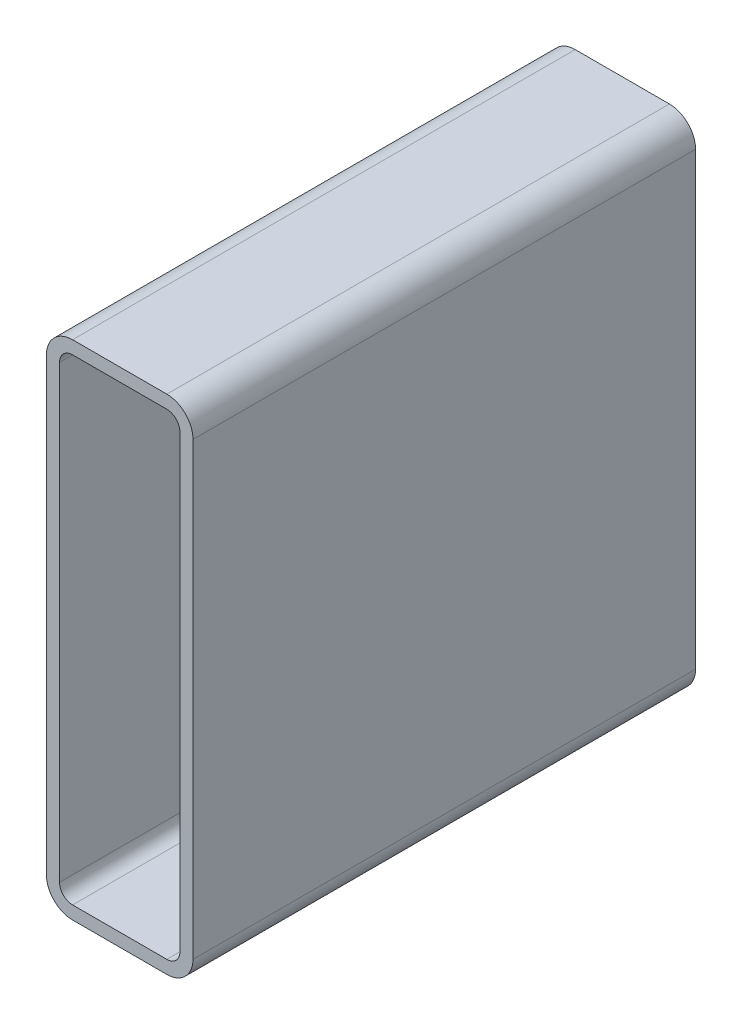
ISO-10303-21;
HEADER;
FILE_DESCRIPTION(('STEP AP214'),'2;1');
FILE_NAME('part.step','',(''),(''),'','','');
FILE_SCHEMA(('AUTOMOTIVE_DESIGN { 1 0 10303 214 1 1 1 1 }'));
ENDSEC;
DATA;
#1=APPLICATION_CONTEXT('core data for automotive mechanical design processes');
#2=APPLICATION_PROTOCOL_DEFINITION('international standard','automotive_design',2000,#1);
#3=PRODUCT_CONTEXT('',#1,'mechanical');
#4=PRODUCT('Part','Part','',(#3));
#5=PRODUCT_RELATED_PRODUCT_CATEGORY('part','',(#4));
#6=PRODUCT_DEFINITION_FORMATION('','',#4);
#7=PRODUCT_DEFINITION_CONTEXT('part definition',#1,'design');
#8=PRODUCT_DEFINITION('design','',#6,#7);
#9=PRODUCT_DEFINITION_SHAPE('','',#8);
#10=(LENGTH_UNIT() NAMED_UNIT(*) SI_UNIT(.MILLI.,.METRE.));
#11=(NAMED_UNIT(*) PLANE_ANGLE_UNIT() SI_UNIT($,.RADIAN.));
#12=(NAMED_UNIT(*) SI_UNIT($,.STERADIAN.) SOLID_ANGLE_UNIT());
#13=UNCERTAINTY_MEASURE_WITH_UNIT(LENGTH_MEASURE(1.E-05),#10,'distance_accuracy_value','');
#14=(GEOMETRIC_REPRESENTATION_CONTEXT(3) GLOBAL_UNCERTAINTY_ASSIGNED_CONTEXT((#13)) GLOBAL_UNIT_ASSIGNED_CONTEXT((#10,
#11,#12)) REPRESENTATION_CONTEXT('',''));
#15=CARTESIAN_POINT('',(0.,0.,0.));
#16=DIRECTION('',(0.,0.,1.));
#17=DIRECTION('',(1.,0.,0.));
#18=AXIS2_PLACEMENT_3D('',#15,#16,#17);
#19=CARTESIAN_POINT('',(17.9571469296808,290.799496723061,304.8));
#20=DIRECTION('',(0.,0.,1.));
#21=DIRECTION('',(1.,0.,0.));
#22=AXIS2_PLACEMENT_3D('',#19,#20,#21);
#23=PLANE('',#22);
#24=CARTESIAN_POINT('',(17.9571469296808,290.799496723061,304.8));
#25=DIRECTION('',(0.,0.,1.));
#26=DIRECTION('',(1.,0.,0.));
#27=AXIS2_PLACEMENT_3D('',#24,#25,#26);
#28=CIRCLE('',#27,15.875);
#29=CARTESIAN_POINT('',(17.9571469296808,306.674496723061,304.8));
#30=VERTEX_POINT('',#29);
#31=CARTESIAN_POINT('',(2.08214692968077,290.799496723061,304.8));
#32=VERTEX_POINT('',#31);
#33=EDGE_CURVE('E211',#30,#32,#28,.T.);
#34=ORIENTED_EDGE('',*,*,#33,.T.);
#35=DIRECTION('',(0.,-1.,0.));
#36=VECTOR('',#35,1.);
#37=CARTESIAN_POINT('',(2.08214692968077,17.7494967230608,304.8));
#38=LINE('',#37,#36);
#39=CARTESIAN_POINT('',(2.08214692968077,17.7494967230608,304.8));
#40=VERTEX_POINT('',#39);
#41=EDGE_CURVE('E214',#32,#40,#38,.T.);
#42=ORIENTED_EDGE('',*,*,#41,.T.);
#43=CARTESIAN_POINT('',(17.9571469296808,17.7494967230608,304.8));
#44=DIRECTION('',(0.,0.,1.));
#45=DIRECTION('',(1.,0.,0.));
#46=AXIS2_PLACEMENT_3D('',#43,#44,#45);
#47=CIRCLE('',#46,15.875);
#48=CARTESIAN_POINT('',(17.9571469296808,1.87449672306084,304.8));
#49=VERTEX_POINT('',#48);
#50=EDGE_CURVE('E217',#40,#49,#47,.T.);
#51=ORIENTED_EDGE('',*,*,#50,.T.);
#52=DIRECTION('',(1.,0.,0.));
#53=VECTOR('',#52,1.);
#54=CARTESIAN_POINT('',(75.1071469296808,1.87449672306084,304.8));
#55=LINE('',#54,#53);
#56=CARTESIAN_POINT('',(75.1071469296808,1.87449672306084,304.8));
#57=VERTEX_POINT('',#56);
#58=EDGE_CURVE('E219',#49,#57,#55,.T.);
#59=ORIENTED_EDGE('',*,*,#58,.T.);
#60=CARTESIAN_POINT('',(75.1071469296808,17.7494967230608,304.8));
#61=DIRECTION('',(0.,0.,1.));
#62=DIRECTION('',(1.,0.,0.));
#63=AXIS2_PLACEMENT_3D('',#60,#61,#62);
#64=CIRCLE('',#63,15.875);
#65=CARTESIAN_POINT('',(90.9821469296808,17.7494967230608,304.8));
#66=VERTEX_POINT('',#65);
#67=EDGE_CURVE('E221',#57,#66,#64,.T.);
#68=ORIENTED_EDGE('',*,*,#67,.T.);
#69=DIRECTION('',(0.,1.,0.));
#70=VECTOR('',#69,1.);
#71=CARTESIAN_POINT('',(90.9821469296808,290.799496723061,304.8));
#72=LINE('',#71,#70);
#73=CARTESIAN_POINT('',(90.9821469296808,290.799496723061,304.8));
#74=VERTEX_POINT('',#73);
#75=EDGE_CURVE('E223',#66,#74,#72,.T.);
#76=ORIENTED_EDGE('',*,*,#75,.T.);
#77=CARTESIAN_POINT('',(75.1071469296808,290.799496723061,304.8));
#78=DIRECTION('',(0.,0.,1.));
#79=DIRECTION('',(1.,0.,0.));
#80=AXIS2_PLACEMENT_3D('',#77,#78,#79);
#81=CIRCLE('',#80,15.875);
#82=CARTESIAN_POINT('',(75.1071469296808,306.674496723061,304.8));
#83=VERTEX_POINT('',#82);
#84=EDGE_CURVE('E225',#74,#83,#81,.T.);
#85=ORIENTED_EDGE('',*,*,#84,.T.);
#86=DIRECTION('',(-1.,0.,0.));
#87=VECTOR('',#86,1.);
#88=CARTESIAN_POINT('',(17.9571469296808,306.674496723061,304.8));
#89=LINE('',#88,#87);
#90=EDGE_CURVE('E227',#83,#30,#89,.T.);
#91=ORIENTED_EDGE('',*,*,#90,.T.);
#92=EDGE_LOOP('',(#34,#42,#51,#59,#68,#76,#85,#91));
#93=FACE_BOUND('',#92,.T.);
#94=DIRECTION('',(0.,-1.,0.));
#95=VECTOR('',#94,1.);
#96=CARTESIAN_POINT('',(10.0196469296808,17.7494967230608,304.8));
#97=LINE('',#96,#95);
#98=CARTESIAN_POINT('',(10.0196469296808,290.799496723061,304.8));
#99=VERTEX_POINT('',#98);
#100=CARTESIAN_POINT('',(10.0196469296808,17.7494967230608,304.8));
#101=VERTEX_POINT('',#100);
#102=EDGE_CURVE('E154',#99,#101,#97,.T.);
#103=ORIENTED_EDGE('',*,*,#102,.F.);
#104=CARTESIAN_POINT('',(17.9571469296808,290.799496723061,304.8));
#105=DIRECTION('',(0.,0.,1.));
#106=DIRECTION('',(1.,0.,0.));
#107=AXIS2_PLACEMENT_3D('',#104,#105,#106);
#108=CIRCLE('',#107,7.9375);
#109=CARTESIAN_POINT('',(17.9571469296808,298.736996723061,304.8));
#110=VERTEX_POINT('',#109);
#111=EDGE_CURVE('E146',#110,#99,#108,.T.);
#112=ORIENTED_EDGE('',*,*,#111,.F.);
#113=DIRECTION('',(-1.,0.,0.));
#114=VECTOR('',#113,1.);
#115=CARTESIAN_POINT('',(17.9571469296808,298.736996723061,304.8));
#116=LINE('',#115,#114);
#117=CARTESIAN_POINT('',(75.1071469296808,298.736996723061,304.8));
#118=VERTEX_POINT('',#117);
#119=EDGE_CURVE('E179',#118,#110,#116,.T.);
#120=ORIENTED_EDGE('',*,*,#119,.F.);
#121=CARTESIAN_POINT('',(75.1071469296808,290.799496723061,304.8));
#122=DIRECTION('',(0.,0.,1.));
#123=DIRECTION('',(1.,0.,0.));
#124=AXIS2_PLACEMENT_3D('',#121,#122,#123);
#125=CIRCLE('',#124,7.93749999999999);
#126=CARTESIAN_POINT('',(83.0446469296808,290.799496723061,304.8));
#127=VERTEX_POINT('',#126);
#128=EDGE_CURVE('E177',#127,#118,#125,.T.);
#129=ORIENTED_EDGE('',*,*,#128,.F.);
#130=DIRECTION('',(0.,1.,0.));
#131=VECTOR('',#130,1.);
#132=CARTESIAN_POINT('',(83.0446469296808,290.799496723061,304.8));
#133=LINE('',#132,#131);
#134=CARTESIAN_POINT('',(83.0446469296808,17.7494967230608,304.8));
#135=VERTEX_POINT('',#134);
#136=EDGE_CURVE('E175',#135,#127,#133,.T.);
#137=ORIENTED_EDGE('',*,*,#136,.F.);
#138=CARTESIAN_POINT('',(75.1071469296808,17.7494967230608,304.8));
#139=DIRECTION('',(0.,0.,1.));
#140=DIRECTION('',(1.,0.,0.));
#141=AXIS2_PLACEMENT_3D('',#138,#139,#140);
#142=CIRCLE('',#141,7.9375);
#143=CARTESIAN_POINT('',(75.1071469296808,9.81199672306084,304.8));
#144=VERTEX_POINT('',#143);
#145=EDGE_CURVE('E173',#144,#135,#142,.T.);
#146=ORIENTED_EDGE('',*,*,#145,.F.);
#147=DIRECTION('',(1.,0.,0.));
#148=VECTOR('',#147,1.);
#149=CARTESIAN_POINT('',(75.1071469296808,9.81199672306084,304.8));
#150=LINE('',#149,#148);
#151=CARTESIAN_POINT('',(17.9571469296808,9.81199672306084,304.8));
#152=VERTEX_POINT('',#151);
#153=EDGE_CURVE('E169',#152,#144,#150,.T.);
#154=ORIENTED_EDGE('',*,*,#153,.F.);
#155=CARTESIAN_POINT('',(17.9571469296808,17.7494967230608,304.8));
#156=DIRECTION('',(0.,0.,1.));
#157=DIRECTION('',(1.,0.,0.));
#158=AXIS2_PLACEMENT_3D('',#155,#156,#157);
#159=CIRCLE('',#158,7.9375);
#160=EDGE_CURVE('E167',#101,#152,#159,.T.);
#161=ORIENTED_EDGE('',*,*,#160,.F.);
#162=EDGE_LOOP('',(#103,#112,#120,#129,#137,#146,#154,#161));
#163=FACE_BOUND('',#162,.T.);
#164=ADVANCED_FACE('F33',(#93,#163),#23,.T.);
#165=CARTESIAN_POINT('',(17.9571469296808,290.799496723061,0.));
#166=DIRECTION('',(0.,0.,1.));
#167=DIRECTION('',(1.,0.,0.));
#168=AXIS2_PLACEMENT_3D('',#165,#166,#167);
#169=PLANE('',#168);
#170=CARTESIAN_POINT('',(17.9571469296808,290.799496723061,0.));
#171=DIRECTION('',(0.,0.,1.));
#172=DIRECTION('',(1.,0.,0.));
#173=AXIS2_PLACEMENT_3D('',#170,#171,#172);
#174=CIRCLE('',#173,15.875);
#175=CARTESIAN_POINT('',(17.9571469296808,306.674496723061,0.));
#176=VERTEX_POINT('',#175);
#177=CARTESIAN_POINT('',(2.08214692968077,290.799496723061,0.));
#178=VERTEX_POINT('',#177);
#179=EDGE_CURVE('E162',#176,#178,#174,.T.);
#180=ORIENTED_EDGE('',*,*,#179,.F.);
#181=DIRECTION('',(-1.,0.,0.));
#182=VECTOR('',#181,1.);
#183=CARTESIAN_POINT('',(17.9571469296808,306.674496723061,0.));
#184=LINE('',#183,#182);
#185=CARTESIAN_POINT('',(75.1071469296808,306.674496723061,0.));
#186=VERTEX_POINT('',#185);
#187=EDGE_CURVE('E215',#186,#176,#184,.T.);
#188=ORIENTED_EDGE('',*,*,#187,.F.);
#189=CARTESIAN_POINT('',(75.1071469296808,290.799496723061,0.));
#190=DIRECTION('',(0.,0.,1.));
#191=DIRECTION('',(1.,0.,0.));
#192=AXIS2_PLACEMENT_3D('',#189,#190,#191);
#193=CIRCLE('',#192,15.875);
#194=CARTESIAN_POINT('',(90.9821469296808,290.799496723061,0.));
#195=VERTEX_POINT('',#194);
#196=EDGE_CURVE('E242',#195,#186,#193,.T.);
#197=ORIENTED_EDGE('',*,*,#196,.F.);
#198=DIRECTION('',(0.,1.,0.));
#199=VECTOR('',#198,1.);
#200=CARTESIAN_POINT('',(90.9821469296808,290.799496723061,0.));
#201=LINE('',#200,#199);
#202=CARTESIAN_POINT('',(90.9821469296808,17.7494967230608,0.));
#203=VERTEX_POINT('',#202);
#204=EDGE_CURVE('E240',#203,#195,#201,.T.);
#205=ORIENTED_EDGE('',*,*,#204,.F.);
#206=CARTESIAN_POINT('',(75.1071469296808,17.7494967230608,0.));
#207=DIRECTION('',(0.,0.,1.));
#208=DIRECTION('',(1.,0.,0.));
#209=AXIS2_PLACEMENT_3D('',#206,#207,#208);
#210=CIRCLE('',#209,15.875);
#211=CARTESIAN_POINT('',(75.1071469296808,1.87449672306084,0.));
#212=VERTEX_POINT('',#211);
#213=EDGE_CURVE('E238',#212,#203,#210,.T.);
#214=ORIENTED_EDGE('',*,*,#213,.F.);
#215=DIRECTION('',(1.,0.,0.));
#216=VECTOR('',#215,1.);
#217=CARTESIAN_POINT('',(75.1071469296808,1.87449672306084,0.));
#218=LINE('',#217,#216);
#219=CARTESIAN_POINT('',(17.9571469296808,1.87449672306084,0.));
#220=VERTEX_POINT('',#219);
#221=EDGE_CURVE('E236',#220,#212,#218,.T.);
#222=ORIENTED_EDGE('',*,*,#221,.F.);
#223=CARTESIAN_POINT('',(17.9571469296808,17.7494967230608,0.));
#224=DIRECTION('',(0.,0.,1.));
#225=DIRECTION('',(1.,0.,0.));
#226=AXIS2_PLACEMENT_3D('',#223,#224,#225);
#227=CIRCLE('',#226,15.875);
#228=CARTESIAN_POINT('',(2.08214692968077,17.7494967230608,0.));
#229=VERTEX_POINT('',#228);
#230=EDGE_CURVE('E234',#229,#220,#227,.T.);
#231=ORIENTED_EDGE('',*,*,#230,.F.);
#232=DIRECTION('',(0.,-1.,0.));
#233=VECTOR('',#232,1.);
#234=CARTESIAN_POINT('',(2.08214692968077,17.7494967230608,0.));
#235=LINE('',#234,#233);
#236=EDGE_CURVE('E232',#178,#229,#235,.T.);
#237=ORIENTED_EDGE('',*,*,#236,.F.);
#238=EDGE_LOOP('',(#180,#188,#197,#205,#214,#222,#231,#237));
#239=FACE_BOUND('',#238,.T.);
#240=CARTESIAN_POINT('',(17.9571469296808,290.799496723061,0.));
#241=DIRECTION('',(0.,0.,1.));
#242=DIRECTION('',(1.,0.,0.));
#243=AXIS2_PLACEMENT_3D('',#240,#241,#242);
#244=CIRCLE('',#243,7.9375);
#245=CARTESIAN_POINT('',(17.9571469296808,298.736996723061,0.));
#246=VERTEX_POINT('',#245);
#247=CARTESIAN_POINT('',(10.0196469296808,290.799496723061,0.));
#248=VERTEX_POINT('',#247);
#249=EDGE_CURVE('E56',#246,#248,#244,.T.);
#250=ORIENTED_EDGE('',*,*,#249,.T.);
#251=DIRECTION('',(0.,-1.,0.));
#252=VECTOR('',#251,1.);
#253=CARTESIAN_POINT('',(10.0196469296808,17.7494967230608,0.));
#254=LINE('',#253,#252);
#255=CARTESIAN_POINT('',(10.0196469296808,17.7494967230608,0.));
#256=VERTEX_POINT('',#255);
#257=EDGE_CURVE('E161',#248,#256,#254,.T.);
#258=ORIENTED_EDGE('',*,*,#257,.T.);
#259=CARTESIAN_POINT('',(17.9571469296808,17.7494967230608,0.));
#260=DIRECTION('',(0.,0.,1.));
#261=DIRECTION('',(1.,0.,0.));
#262=AXIS2_PLACEMENT_3D('',#259,#260,#261);
#263=CIRCLE('',#262,7.9375);
#264=CARTESIAN_POINT('',(17.9571469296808,9.81199672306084,0.));
#265=VERTEX_POINT('',#264);
#266=EDGE_CURVE('E183',#256,#265,#263,.T.);
#267=ORIENTED_EDGE('',*,*,#266,.T.);
#268=DIRECTION('',(1.,0.,0.));
#269=VECTOR('',#268,1.);
#270=CARTESIAN_POINT('',(75.1071469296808,9.81199672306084,0.));
#271=LINE('',#270,#269);
#272=CARTESIAN_POINT('',(75.1071469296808,9.81199672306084,0.));
#273=VERTEX_POINT('',#272);
#274=EDGE_CURVE('E186',#265,#273,#271,.T.);
#275=ORIENTED_EDGE('',*,*,#274,.T.);
#276=CARTESIAN_POINT('',(75.1071469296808,17.7494967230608,0.));
#277=DIRECTION('',(0.,0.,1.));
#278=DIRECTION('',(1.,0.,0.));
#279=AXIS2_PLACEMENT_3D('',#276,#277,#278);
#280=CIRCLE('',#279,7.9375);
#281=CARTESIAN_POINT('',(83.0446469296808,17.7494967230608,0.));
#282=VERTEX_POINT('',#281);
#283=EDGE_CURVE('E189',#273,#282,#280,.T.);
#284=ORIENTED_EDGE('',*,*,#283,.T.);
#285=DIRECTION('',(0.,1.,0.));
#286=VECTOR('',#285,1.);
#287=CARTESIAN_POINT('',(83.0446469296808,290.799496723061,0.));
#288=LINE('',#287,#286);
#289=CARTESIAN_POINT('',(83.0446469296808,290.799496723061,0.));
#290=VERTEX_POINT('',#289);
#291=EDGE_CURVE('E192',#282,#290,#288,.T.);
#292=ORIENTED_EDGE('',*,*,#291,.T.);
#293=CARTESIAN_POINT('',(75.1071469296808,290.799496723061,0.));
#294=DIRECTION('',(0.,0.,1.));
#295=DIRECTION('',(1.,0.,0.));
#296=AXIS2_PLACEMENT_3D('',#293,#294,#295);
#297=CIRCLE('',#296,7.93749999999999);
#298=CARTESIAN_POINT('',(75.1071469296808,298.736996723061,0.));
#299=VERTEX_POINT('',#298);
#300=EDGE_CURVE('E195',#290,#299,#297,.T.);
#301=ORIENTED_EDGE('',*,*,#300,.T.);
#302=DIRECTION('',(-1.,0.,0.));
#303=VECTOR('',#302,1.);
#304=CARTESIAN_POINT('',(17.9571469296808,298.736996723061,0.));
#305=LINE('',#304,#303);
#306=EDGE_CURVE('E155',#299,#246,#305,.T.);
#307=ORIENTED_EDGE('',*,*,#306,.T.);
#308=EDGE_LOOP('',(#250,#258,#267,#275,#284,#292,#301,#307));
#309=FACE_BOUND('',#308,.T.);
#310=ADVANCED_FACE('F272',(#239,#309),#169,.F.);
#311=CARTESIAN_POINT('',(17.9571469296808,290.799496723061,304.8));
#312=DIRECTION('',(0.,0.,-1.));
#313=DIRECTION('',(-1.,0.,0.));
#314=AXIS2_PLACEMENT_3D('',#311,#312,#313);
#315=CYLINDRICAL_SURFACE('',#314,15.875);
#316=ORIENTED_EDGE('',*,*,#179,.T.);
#317=DIRECTION('',(0.,0.,-1.));
#318=VECTOR('',#317,1.);
#319=CARTESIAN_POINT('',(2.08214692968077,290.799496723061,304.8));
#320=LINE('',#319,#318);
#321=EDGE_CURVE('E11',#32,#178,#320,.T.);
#322=ORIENTED_EDGE('',*,*,#321,.F.);
#323=ORIENTED_EDGE('',*,*,#33,.F.);
#324=DIRECTION('',(0.,0.,-1.));
#325=VECTOR('',#324,1.);
#326=CARTESIAN_POINT('',(17.9571469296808,306.674496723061,304.8));
#327=LINE('',#326,#325);
#328=EDGE_CURVE('E229',#30,#176,#327,.T.);
#329=ORIENTED_EDGE('',*,*,#328,.T.);
#330=EDGE_LOOP('',(#316,#322,#323,#329));
#331=FACE_BOUND('',#330,.T.);
#332=ADVANCED_FACE('F35',(#331),#315,.T.);
#333=CARTESIAN_POINT('',(2.08214692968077,17.7494967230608,304.8));
#334=DIRECTION('',(1.,0.,0.));
#335=DIRECTION('',(0.,0.,-1.));
#336=AXIS2_PLACEMENT_3D('',#333,#334,#335);
#337=PLANE('',#336);
#338=ORIENTED_EDGE('',*,*,#236,.T.);
#339=DIRECTION('',(0.,0.,-1.));
#340=VECTOR('',#339,1.);
#341=CARTESIAN_POINT('',(2.08214692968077,17.7494967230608,304.8));
#342=LINE('',#341,#340);
#343=EDGE_CURVE('E41',#40,#229,#342,.T.);
#344=ORIENTED_EDGE('',*,*,#343,.F.);
#345=ORIENTED_EDGE('',*,*,#41,.F.);
#346=ORIENTED_EDGE('',*,*,#321,.T.);
#347=EDGE_LOOP('',(#338,#344,#345,#346));
#348=FACE_BOUND('',#347,.T.);
#349=ADVANCED_FACE('F289',(#348),#337,.F.);
#350=CARTESIAN_POINT('',(17.9571469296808,17.7494967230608,304.8));
#351=DIRECTION('',(0.,0.,-1.));
#352=DIRECTION('',(-1.,0.,0.));
#353=AXIS2_PLACEMENT_3D('',#350,#351,#352);
#354=CYLINDRICAL_SURFACE('',#353,15.875);
#355=ORIENTED_EDGE('',*,*,#230,.T.);
#356=DIRECTION('',(0.,0.,-1.));
#357=VECTOR('',#356,1.);
#358=CARTESIAN_POINT('',(17.9571469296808,1.87449672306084,304.8));
#359=LINE('',#358,#357);
#360=EDGE_CURVE('E259',#49,#220,#359,.T.);
#361=ORIENTED_EDGE('',*,*,#360,.F.);
#362=ORIENTED_EDGE('',*,*,#50,.F.);
#363=ORIENTED_EDGE('',*,*,#343,.T.);
#364=EDGE_LOOP('',(#355,#361,#362,#363));
#365=FACE_BOUND('',#364,.T.);
#366=ADVANCED_FACE('F266',(#365),#354,.T.);
#367=CARTESIAN_POINT('',(75.1071469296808,1.87449672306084,304.8));
#368=DIRECTION('',(0.,1.,0.));
#369=DIRECTION('',(0.,0.,1.));
#370=AXIS2_PLACEMENT_3D('',#367,#368,#369);
#371=PLANE('',#370);
#372=ORIENTED_EDGE('',*,*,#221,.T.);
#373=DIRECTION('',(0.,0.,-1.));
#374=VECTOR('',#373,1.);
#375=CARTESIAN_POINT('',(75.1071469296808,1.87449672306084,304.8));
#376=LINE('',#375,#374);
#377=EDGE_CURVE('E256',#57,#212,#376,.T.);
#378=ORIENTED_EDGE('',*,*,#377,.F.);
#379=ORIENTED_EDGE('',*,*,#58,.F.);
#380=ORIENTED_EDGE('',*,*,#360,.T.);
#381=EDGE_LOOP('',(#372,#378,#379,#380));
#382=FACE_BOUND('',#381,.T.);
#383=ADVANCED_FACE('F278',(#382),#371,.F.);
#384=CARTESIAN_POINT('',(75.1071469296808,17.7494967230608,304.8));
#385=DIRECTION('',(0.,0.,-1.));
#386=DIRECTION('',(-1.,0.,0.));
#387=AXIS2_PLACEMENT_3D('',#384,#385,#386);
#388=CYLINDRICAL_SURFACE('',#387,15.875);
#389=ORIENTED_EDGE('',*,*,#213,.T.);
#390=DIRECTION('',(0.,0.,-1.));
#391=VECTOR('',#390,1.);
#392=CARTESIAN_POINT('',(90.9821469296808,17.7494967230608,304.8));
#393=LINE('',#392,#391);
#394=EDGE_CURVE('E253',#66,#203,#393,.T.);
#395=ORIENTED_EDGE('',*,*,#394,.F.);
#396=ORIENTED_EDGE('',*,*,#67,.F.);
#397=ORIENTED_EDGE('',*,*,#377,.T.);
#398=EDGE_LOOP('',(#389,#395,#396,#397));
#399=FACE_BOUND('',#398,.T.);
#400=ADVANCED_FACE('F282',(#399),#388,.T.);
#401=CARTESIAN_POINT('',(90.9821469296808,290.799496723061,304.8));
#402=DIRECTION('',(-1.,0.,0.));
#403=DIRECTION('',(0.,0.,1.));
#404=AXIS2_PLACEMENT_3D('',#401,#402,#403);
#405=PLANE('',#404);
#406=ORIENTED_EDGE('',*,*,#204,.T.);
#407=DIRECTION('',(0.,0.,-1.));
#408=VECTOR('',#407,1.);
#409=CARTESIAN_POINT('',(90.9821469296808,290.799496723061,304.8));
#410=LINE('',#409,#408);
#411=EDGE_CURVE('E250',#74,#195,#410,.T.);
#412=ORIENTED_EDGE('',*,*,#411,.F.);
#413=ORIENTED_EDGE('',*,*,#75,.F.);
#414=ORIENTED_EDGE('',*,*,#394,.T.);
#415=EDGE_LOOP('',(#406,#412,#413,#414));
#416=FACE_BOUND('',#415,.T.);
#417=ADVANCED_FACE('F302',(#416),#405,.F.);
#418=CARTESIAN_POINT('',(75.1071469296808,290.799496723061,304.8));
#419=DIRECTION('',(0.,0.,-1.));
#420=DIRECTION('',(-1.,0.,0.));
#421=AXIS2_PLACEMENT_3D('',#418,#419,#420);
#422=CYLINDRICAL_SURFACE('',#421,15.875);
#423=ORIENTED_EDGE('',*,*,#196,.T.);
#424=DIRECTION('',(0.,0.,-1.));
#425=VECTOR('',#424,1.);
#426=CARTESIAN_POINT('',(75.1071469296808,306.674496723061,304.8));
#427=LINE('',#426,#425);
#428=EDGE_CURVE('E247',#83,#186,#427,.T.);
#429=ORIENTED_EDGE('',*,*,#428,.F.);
#430=ORIENTED_EDGE('',*,*,#84,.F.);
#431=ORIENTED_EDGE('',*,*,#411,.T.);
#432=EDGE_LOOP('',(#423,#429,#430,#431));
#433=FACE_BOUND('',#432,.T.);
#434=ADVANCED_FACE('F300',(#433),#422,.T.);
#435=CARTESIAN_POINT('',(17.9571469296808,306.674496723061,304.8));
#436=DIRECTION('',(0.,-1.,0.));
#437=DIRECTION('',(0.,0.,-1.));
#438=AXIS2_PLACEMENT_3D('',#435,#436,#437);
#439=PLANE('',#438);
#440=ORIENTED_EDGE('',*,*,#187,.T.);
#441=ORIENTED_EDGE('',*,*,#328,.F.);
#442=ORIENTED_EDGE('',*,*,#90,.F.);
#443=ORIENTED_EDGE('',*,*,#428,.T.);
#444=EDGE_LOOP('',(#440,#441,#442,#443));
#445=FACE_BOUND('',#444,.T.);
#446=ADVANCED_FACE('F295',(#445),#439,.F.);
#447=CARTESIAN_POINT('',(17.9571469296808,290.799496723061,304.8));
#448=DIRECTION('',(0.,0.,-1.));
#449=DIRECTION('',(-1.,0.,0.));
#450=AXIS2_PLACEMENT_3D('',#447,#448,#449);
#451=CYLINDRICAL_SURFACE('',#450,7.9375);
#452=ORIENTED_EDGE('',*,*,#249,.F.);
#453=DIRECTION('',(0.,0.,-1.));
#454=VECTOR('',#453,1.);
#455=CARTESIAN_POINT('',(17.9571469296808,298.736996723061,304.8));
#456=LINE('',#455,#454);
#457=EDGE_CURVE('E150',#110,#246,#456,.T.);
#458=ORIENTED_EDGE('',*,*,#457,.F.);
#459=ORIENTED_EDGE('',*,*,#111,.T.);
#460=DIRECTION('',(0.,0.,-1.));
#461=VECTOR('',#460,1.);
#462=CARTESIAN_POINT('',(10.0196469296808,290.799496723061,304.8));
#463=LINE('',#462,#461);
#464=EDGE_CURVE('E149',#99,#248,#463,.T.);
#465=ORIENTED_EDGE('',*,*,#464,.T.);
#466=EDGE_LOOP('',(#452,#458,#459,#465));
#467=FACE_BOUND('',#466,.T.);
#468=ADVANCED_FACE('F148',(#467),#451,.F.);
#469=CARTESIAN_POINT('',(10.0196469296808,17.7494967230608,304.8));
#470=DIRECTION('',(1.,0.,0.));
#471=DIRECTION('',(0.,0.,-1.));
#472=AXIS2_PLACEMENT_3D('',#469,#470,#471);
#473=PLANE('',#472);
#474=ORIENTED_EDGE('',*,*,#257,.F.);
#475=ORIENTED_EDGE('',*,*,#464,.F.);
#476=ORIENTED_EDGE('',*,*,#102,.T.);
#477=DIRECTION('',(0.,0.,-1.));
#478=VECTOR('',#477,1.);
#479=CARTESIAN_POINT('',(10.0196469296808,17.7494967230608,304.8));
#480=LINE('',#479,#478);
#481=EDGE_CURVE('E163',#101,#256,#480,.T.);
#482=ORIENTED_EDGE('',*,*,#481,.T.);
#483=EDGE_LOOP('',(#474,#475,#476,#482));
#484=FACE_BOUND('',#483,.T.);
#485=ADVANCED_FACE('F158',(#484),#473,.T.);
#486=CARTESIAN_POINT('',(17.9571469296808,17.7494967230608,304.8));
#487=DIRECTION('',(0.,0.,-1.));
#488=DIRECTION('',(-1.,0.,0.));
#489=AXIS2_PLACEMENT_3D('',#486,#487,#488);
#490=CYLINDRICAL_SURFACE('',#489,7.9375);
#491=ORIENTED_EDGE('',*,*,#266,.F.);
#492=ORIENTED_EDGE('',*,*,#481,.F.);
#493=ORIENTED_EDGE('',*,*,#160,.T.);
#494=DIRECTION('',(0.,0.,-1.));
#495=VECTOR('',#494,1.);
#496=CARTESIAN_POINT('',(17.9571469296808,9.81199672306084,304.8));
#497=LINE('',#496,#495);
#498=EDGE_CURVE('E208',#152,#265,#497,.T.);
#499=ORIENTED_EDGE('',*,*,#498,.T.);
#500=EDGE_LOOP('',(#491,#492,#493,#499));
#501=FACE_BOUND('',#500,.T.);
#502=ADVANCED_FACE('F327',(#501),#490,.F.);
#503=CARTESIAN_POINT('',(75.1071469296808,9.81199672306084,304.8));
#504=DIRECTION('',(0.,1.,0.));
#505=DIRECTION('',(0.,0.,1.));
#506=AXIS2_PLACEMENT_3D('',#503,#504,#505);
#507=PLANE('',#506);
#508=ORIENTED_EDGE('',*,*,#274,.F.);
#509=ORIENTED_EDGE('',*,*,#498,.F.);
#510=ORIENTED_EDGE('',*,*,#153,.T.);
#511=DIRECTION('',(0.,0.,-1.));
#512=VECTOR('',#511,1.);
#513=CARTESIAN_POINT('',(75.1071469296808,9.81199672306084,304.8));
#514=LINE('',#513,#512);
#515=EDGE_CURVE('E206',#144,#273,#514,.T.);
#516=ORIENTED_EDGE('',*,*,#515,.T.);
#517=EDGE_LOOP('',(#508,#509,#510,#516));
#518=FACE_BOUND('',#517,.T.);
#519=ADVANCED_FACE('F331',(#518),#507,.T.);
#520=CARTESIAN_POINT('',(75.1071469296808,17.7494967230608,304.8));
#521=DIRECTION('',(0.,0.,-1.));
#522=DIRECTION('',(-1.,0.,0.));
#523=AXIS2_PLACEMENT_3D('',#520,#521,#522);
#524=CYLINDRICAL_SURFACE('',#523,7.9375);
#525=ORIENTED_EDGE('',*,*,#283,.F.);
#526=ORIENTED_EDGE('',*,*,#515,.F.);
#527=ORIENTED_EDGE('',*,*,#145,.T.);
#528=DIRECTION('',(0.,0.,-1.));
#529=VECTOR('',#528,1.);
#530=CARTESIAN_POINT('',(83.0446469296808,17.7494967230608,304.8));
#531=LINE('',#530,#529);
#532=EDGE_CURVE('E204',#135,#282,#531,.T.);
#533=ORIENTED_EDGE('',*,*,#532,.T.);
#534=EDGE_LOOP('',(#525,#526,#527,#533));
#535=FACE_BOUND('',#534,.T.);
#536=ADVANCED_FACE('F337',(#535),#524,.F.);
#537=CARTESIAN_POINT('',(83.0446469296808,290.799496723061,304.8));
#538=DIRECTION('',(-1.,0.,0.));
#539=DIRECTION('',(0.,0.,1.));
#540=AXIS2_PLACEMENT_3D('',#537,#538,#539);
#541=PLANE('',#540);
#542=ORIENTED_EDGE('',*,*,#291,.F.);
#543=ORIENTED_EDGE('',*,*,#532,.F.);
#544=ORIENTED_EDGE('',*,*,#136,.T.);
#545=DIRECTION('',(0.,0.,-1.));
#546=VECTOR('',#545,1.);
#547=CARTESIAN_POINT('',(83.0446469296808,290.799496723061,304.8));
#548=LINE('',#547,#546);
#549=EDGE_CURVE('E202',#127,#290,#548,.T.);
#550=ORIENTED_EDGE('',*,*,#549,.T.);
#551=EDGE_LOOP('',(#542,#543,#544,#550));
#552=FACE_BOUND('',#551,.T.);
#553=ADVANCED_FACE('F341',(#552),#541,.T.);
#554=CARTESIAN_POINT('',(75.1071469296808,290.799496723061,304.8));
#555=DIRECTION('',(0.,0.,-1.));
#556=DIRECTION('',(-1.,0.,0.));
#557=AXIS2_PLACEMENT_3D('',#554,#555,#556);
#558=CYLINDRICAL_SURFACE('',#557,7.93749999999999);
#559=ORIENTED_EDGE('',*,*,#300,.F.);
#560=ORIENTED_EDGE('',*,*,#549,.F.);
#561=ORIENTED_EDGE('',*,*,#128,.T.);
#562=DIRECTION('',(0.,0.,-1.));
#563=VECTOR('',#562,1.);
#564=CARTESIAN_POINT('',(75.1071469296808,298.736996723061,304.8));
#565=LINE('',#564,#563);
#566=EDGE_CURVE('E48',#118,#299,#565,.T.);
#567=ORIENTED_EDGE('',*,*,#566,.T.);
#568=EDGE_LOOP('',(#559,#560,#561,#567));
#569=FACE_BOUND('',#568,.T.);
#570=ADVANCED_FACE('F345',(#569),#558,.F.);
#571=CARTESIAN_POINT('',(17.9571469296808,298.736996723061,304.8));
#572=DIRECTION('',(0.,-1.,0.));
#573=DIRECTION('',(0.,0.,-1.));
#574=AXIS2_PLACEMENT_3D('',#571,#572,#573);
#575=PLANE('',#574);
#576=ORIENTED_EDGE('',*,*,#306,.F.);
#577=ORIENTED_EDGE('',*,*,#566,.F.);
#578=ORIENTED_EDGE('',*,*,#119,.T.);
#579=ORIENTED_EDGE('',*,*,#457,.T.);
#580=EDGE_LOOP('',(#576,#577,#578,#579));
#581=FACE_BOUND('',#580,.T.);
#582=ADVANCED_FACE('F349',(#581),#575,.T.);
#583=CLOSED_SHELL('',(#164,#310,#332,#349,#366,#383,#400,#417,#434,#446,#468,#485,#502,#519,
#536,#553,#570,#582));
#584=MANIFOLD_SOLID_BREP('B2',#583);
#585=ADVANCED_BREP_SHAPE_REPRESENTATION('',(#18,#584),#14);
#586=SHAPE_DEFINITION_REPRESENTATION(#9,#585);
ENDSEC;
END-ISO-10303-21;
